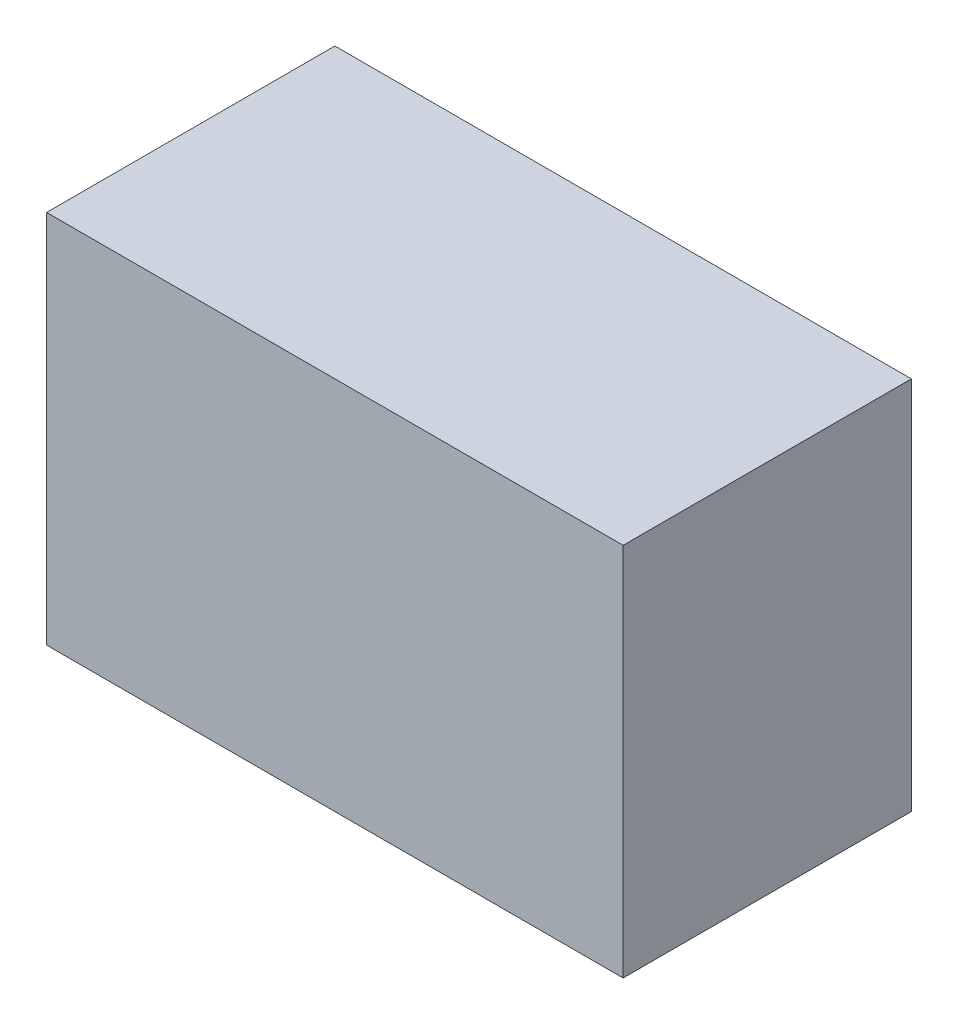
from build123d import *

# Parameters (mm, degrees)
GENERAL_W           = 5.08
GENERAL_H           = 3.302
BOSS_EXTRUDE1_DEPTH = 2.54


with BuildPart() as part:
    # GENERAL → Boss-Extrude1 (new body)
    with BuildSketch(Plane.XY):
        with Locations((0, -0.762)):
            Rectangle(GENERAL_W, GENERAL_H)
    extrude(amount=BOSS_EXTRUDE1_DEPTH)


solid = part.part
